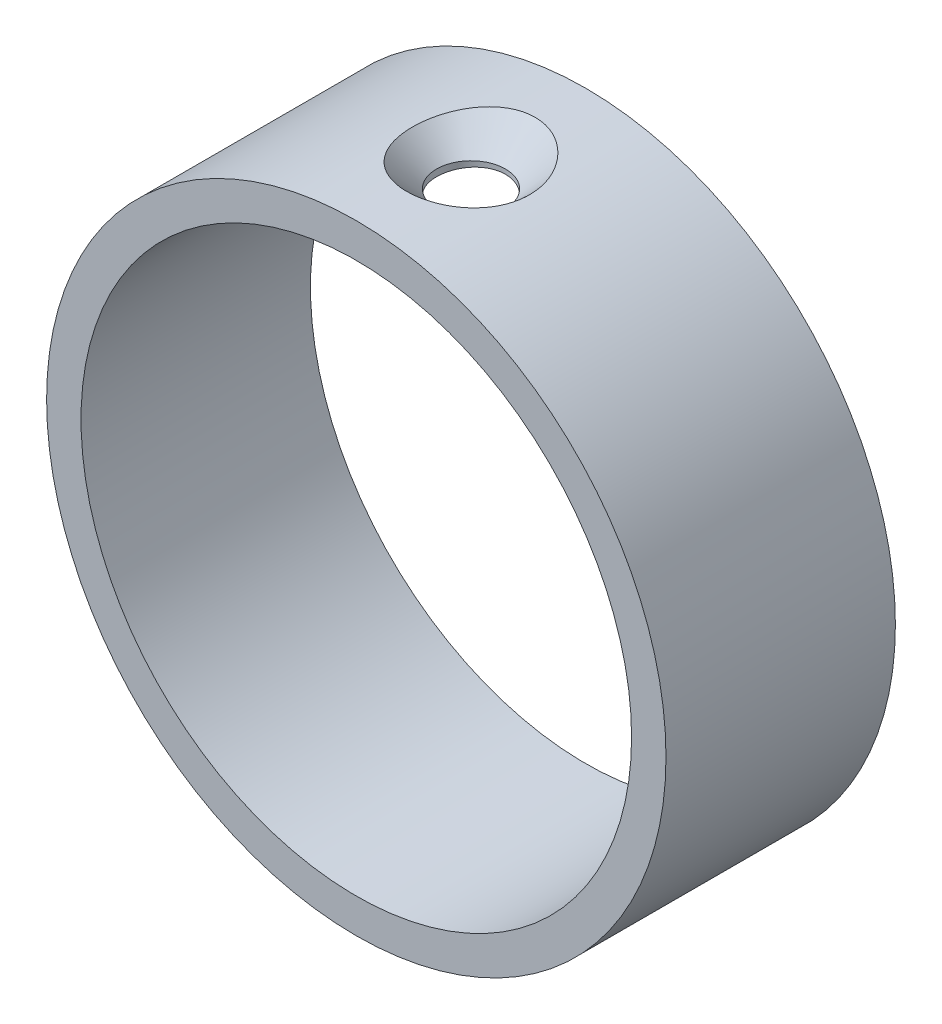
ISO-10303-21;
HEADER;
FILE_DESCRIPTION(('STEP AP214'),'2;1');
FILE_NAME('part.step','',(''),(''),'','','');
FILE_SCHEMA(('AUTOMOTIVE_DESIGN { 1 0 10303 214 1 1 1 1 }'));
ENDSEC;
DATA;
#1=APPLICATION_CONTEXT('core data for automotive mechanical design processes');
#2=APPLICATION_PROTOCOL_DEFINITION('international standard','automotive_design',2000,#1);
#3=PRODUCT_CONTEXT('',#1,'mechanical');
#4=PRODUCT('Part','Part','',(#3));
#5=PRODUCT_RELATED_PRODUCT_CATEGORY('part','',(#4));
#6=PRODUCT_DEFINITION_FORMATION('','',#4);
#7=PRODUCT_DEFINITION_CONTEXT('part definition',#1,'design');
#8=PRODUCT_DEFINITION('design','',#6,#7);
#9=PRODUCT_DEFINITION_SHAPE('','',#8);
#10=(LENGTH_UNIT() NAMED_UNIT(*) SI_UNIT(.MILLI.,.METRE.));
#11=(NAMED_UNIT(*) PLANE_ANGLE_UNIT() SI_UNIT($,.RADIAN.));
#12=(NAMED_UNIT(*) SI_UNIT($,.STERADIAN.) SOLID_ANGLE_UNIT());
#13=UNCERTAINTY_MEASURE_WITH_UNIT(LENGTH_MEASURE(1.E-05),#10,'distance_accuracy_value','');
#14=(GEOMETRIC_REPRESENTATION_CONTEXT(3) GLOBAL_UNCERTAINTY_ASSIGNED_CONTEXT((#13)) GLOBAL_UNIT_ASSIGNED_CONTEXT((#10,
#11,#12)) REPRESENTATION_CONTEXT('',''));
#15=CARTESIAN_POINT('',(0.,0.,0.));
#16=DIRECTION('',(0.,0.,1.));
#17=DIRECTION('',(1.,0.,0.));
#18=AXIS2_PLACEMENT_3D('',#15,#16,#17);
#19=CARTESIAN_POINT('',(0.,0.,5.));
#20=DIRECTION('',(0.,0.,1.));
#21=DIRECTION('',(1.,0.,0.));
#22=AXIS2_PLACEMENT_3D('',#19,#20,#21);
#23=PLANE('',#22);
#24=CARTESIAN_POINT('',(0.,0.,5.));
#25=DIRECTION('',(0.,0.,1.));
#26=DIRECTION('',(1.,0.,0.));
#27=AXIS2_PLACEMENT_3D('',#24,#25,#26);
#28=CIRCLE('',#27,13.5);
#29=CARTESIAN_POINT('',(13.5,0.,5.));
#30=VERTEX_POINT('',#29);
#31=EDGE_CURVE('E10',#30,#30,#28,.T.);
#32=ORIENTED_EDGE('',*,*,#31,.T.);
#33=EDGE_LOOP('',(#32));
#34=FACE_BOUND('',#33,.T.);
#35=CARTESIAN_POINT('',(0.,0.,5.));
#36=DIRECTION('',(0.,0.,1.));
#37=DIRECTION('',(1.,0.,0.));
#38=AXIS2_PLACEMENT_3D('',#35,#36,#37);
#39=CIRCLE('',#38,12.);
#40=CARTESIAN_POINT('',(12.,0.,5.));
#41=VERTEX_POINT('',#40);
#42=EDGE_CURVE('E47',#41,#41,#39,.T.);
#43=ORIENTED_EDGE('',*,*,#42,.F.);
#44=EDGE_LOOP('',(#43));
#45=FACE_BOUND('',#44,.T.);
#46=ADVANCED_FACE('F30',(#34,#45),#23,.T.);
#47=CARTESIAN_POINT('',(0.,0.,-5.));
#48=DIRECTION('',(0.,0.,1.));
#49=DIRECTION('',(1.,0.,0.));
#50=AXIS2_PLACEMENT_3D('',#47,#48,#49);
#51=PLANE('',#50);
#52=CARTESIAN_POINT('',(0.,0.,-5.));
#53=DIRECTION('',(0.,0.,1.));
#54=DIRECTION('',(1.,0.,0.));
#55=AXIS2_PLACEMENT_3D('',#52,#53,#54);
#56=CIRCLE('',#55,13.5);
#57=CARTESIAN_POINT('',(13.5,0.,-5.));
#58=VERTEX_POINT('',#57);
#59=EDGE_CURVE('E42',#58,#58,#56,.T.);
#60=ORIENTED_EDGE('',*,*,#59,.F.);
#61=EDGE_LOOP('',(#60));
#62=FACE_BOUND('',#61,.T.);
#63=CARTESIAN_POINT('',(0.,0.,-5.));
#64=DIRECTION('',(0.,0.,1.));
#65=DIRECTION('',(1.,0.,0.));
#66=AXIS2_PLACEMENT_3D('',#63,#64,#65);
#67=CIRCLE('',#66,12.);
#68=CARTESIAN_POINT('',(12.,0.,-5.));
#69=VERTEX_POINT('',#68);
#70=EDGE_CURVE('E50',#69,#69,#67,.T.);
#71=ORIENTED_EDGE('',*,*,#70,.T.);
#72=EDGE_LOOP('',(#71));
#73=FACE_BOUND('',#72,.T.);
#74=ADVANCED_FACE('F77',(#62,#73),#51,.F.);
#75=CARTESIAN_POINT('',(0.,0.,5.));
#76=DIRECTION('',(0.,0.,-1.));
#77=DIRECTION('',(-1.,0.,0.));
#78=AXIS2_PLACEMENT_3D('',#75,#76,#77);
#79=CYLINDRICAL_SURFACE('',#78,13.5);
#80=CARTESIAN_POINT('',(-1.6988849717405,13.3926767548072,-2.08909016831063));
#81=CARTESIAN_POINT('',(-1.60373888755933,13.4047455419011,-2.18202193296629));
#82=CARTESIAN_POINT('',(-1.50160873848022,13.416669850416,-2.26782974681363));
#83=CARTESIAN_POINT('',(-1.28508464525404,13.4391365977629,-2.4226034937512));
#84=CARTESIAN_POINT('',(-1.17068915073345,13.4496788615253,-2.49156729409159));
#85=CARTESIAN_POINT('',(-0.921974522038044,13.4691036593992,-2.61507944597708));
#86=CARTESIAN_POINT('',(-0.786789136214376,13.4777731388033,-2.66793596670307));
#87=CARTESIAN_POINT('',(-0.508848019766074,13.4911223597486,-2.74814392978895));
#88=CARTESIAN_POINT('',(-0.36609473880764,13.4958033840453,-2.77550357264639));
#89=CARTESIAN_POINT('',(-0.0899266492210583,13.5003478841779,-2.80204928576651));
#90=CARTESIAN_POINT('',(0.043278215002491,13.5005794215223,-2.80338792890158));
#91=CARTESIAN_POINT('',(0.30788108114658,13.4971369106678,-2.78330297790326));
#92=CARTESIAN_POINT('',(0.439279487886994,13.4934637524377,-2.76188457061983));
#93=CARTESIAN_POINT('',(0.69287437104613,13.4827894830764,-2.69822903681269));
#94=CARTESIAN_POINT('',(0.815224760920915,13.4758830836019,-2.65658320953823));
#95=CARTESIAN_POINT('',(1.05160814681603,13.4595013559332,-2.55450264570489));
#96=CARTESIAN_POINT('',(1.16563965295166,13.4500255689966,-2.49406455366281));
#97=CARTESIAN_POINT('',(1.38857166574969,13.4288887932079,-2.35305315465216));
#98=CARTESIAN_POINT('',(1.49691037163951,13.4171407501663,-2.2716072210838));
#99=CARTESIAN_POINT('',(1.69973629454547,13.3929590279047,-2.09309548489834));
#100=CARTESIAN_POINT('',(1.79421845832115,13.3805251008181,-1.99602401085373));
#101=CARTESIAN_POINT('',(1.97583201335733,13.3549716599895,-1.77947537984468));
#102=CARTESIAN_POINT('',(2.06149250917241,13.3418939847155,-1.65875944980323));
#103=CARTESIAN_POINT('',(2.21318560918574,13.3175720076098,-1.40540593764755));
#104=CARTESIAN_POINT('',(2.2792109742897,13.3063283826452,-1.2727639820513));
#105=CARTESIAN_POINT('',(2.39519974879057,13.2859620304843,-0.987745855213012));
#106=CARTESIAN_POINT('',(2.44342300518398,13.2770857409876,-0.834641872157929));
#107=CARTESIAN_POINT('',(2.5149932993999,13.2637150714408,-0.522539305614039));
#108=CARTESIAN_POINT('',(2.53833474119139,13.2592216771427,-0.363539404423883));
#109=CARTESIAN_POINT('',(2.56019163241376,13.2550203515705,-0.037139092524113));
#110=CARTESIAN_POINT('',(2.55763906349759,13.2555182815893,0.130336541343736));
#111=CARTESIAN_POINT('',(2.52516204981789,13.2617427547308,0.462532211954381));
#112=CARTESIAN_POINT('',(2.49523417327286,13.2674699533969,0.627251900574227));
#113=CARTESIAN_POINT('',(2.40823906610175,13.2835366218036,0.950347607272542));
#114=CARTESIAN_POINT('',(2.35099012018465,13.2939069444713,1.10867333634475));
#115=CARTESIAN_POINT('',(2.21029518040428,13.3180203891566,1.41300525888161));
#116=CARTESIAN_POINT('',(2.12684818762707,13.3317636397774,1.55901098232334));
#117=CARTESIAN_POINT('',(1.93774382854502,13.3605404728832,1.83032398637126));
#118=CARTESIAN_POINT('',(1.83269338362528,13.375533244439,1.95605722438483));
#119=CARTESIAN_POINT('',(1.60138135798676,13.4051898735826,2.18632276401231));
#120=CARTESIAN_POINT('',(1.47512956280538,13.4198538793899,2.29086479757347));
#121=CARTESIAN_POINT('',(1.21456702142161,13.4458423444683,2.46723423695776));
#122=CARTESIAN_POINT('',(1.08151420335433,13.4573323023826,2.54089061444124));
#123=CARTESIAN_POINT('',(0.803798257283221,13.4767649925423,2.66216904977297));
#124=CARTESIAN_POINT('',(0.659145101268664,13.4847107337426,2.70981319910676));
#125=CARTESIAN_POINT('',(0.377921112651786,13.495369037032,2.77306980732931));
#126=CARTESIAN_POINT('',(0.24197345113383,13.4985227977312,2.79139255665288));
#127=CARTESIAN_POINT('',(-0.0310390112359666,13.5006532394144,2.80380886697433));
#128=CARTESIAN_POINT('',(-0.168103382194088,13.4996314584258,2.7979113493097));
#129=CARTESIAN_POINT('',(-0.431383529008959,13.4937134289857,2.76321970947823));
#130=CARTESIAN_POINT('',(-0.557778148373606,13.4890363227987,2.7357201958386));
#131=CARTESIAN_POINT('',(-0.804279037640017,13.4765862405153,2.66066329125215));
#132=CARTESIAN_POINT('',(-0.924384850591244,13.4688130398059,2.61310444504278));
#133=CARTESIAN_POINT('',(-1.15851937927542,13.4507248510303,2.49833567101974));
#134=CARTESIAN_POINT('',(-1.27230479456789,13.4403483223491,2.43064126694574));
#135=CARTESIAN_POINT('',(-1.48794145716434,13.418189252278,2.2785702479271));
#136=CARTESIAN_POINT('',(-1.58978893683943,13.4064062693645,2.19418838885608));
#137=CARTESIAN_POINT('',(-1.7877780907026,13.3815034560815,2.00363624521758));
#138=CARTESIAN_POINT('',(-1.88272909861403,13.3683542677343,1.89623356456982));
#139=CARTESIAN_POINT('',(-2.05502684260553,13.3429556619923,1.66804635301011));
#140=CARTESIAN_POINT('',(-2.13236664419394,13.3307066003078,1.54725657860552));
#141=CARTESIAN_POINT('',(-2.27444375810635,13.3072374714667,1.28404029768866));
#142=CARTESIAN_POINT('',(-2.33742103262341,13.2962091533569,1.14064487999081));
#143=CARTESIAN_POINT('',(-2.44011898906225,13.2777463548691,0.845539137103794));
#144=CARTESIAN_POINT('',(-2.47983360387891,13.270312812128,0.693826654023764));
#145=CARTESIAN_POINT('',(-2.53693349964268,13.2595204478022,0.377299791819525));
#146=CARTESIAN_POINT('',(-2.55294435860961,13.2564130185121,0.212227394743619));
#147=CARTESIAN_POINT('',(-2.558037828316,13.2554307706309,-0.118376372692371));
#148=CARTESIAN_POINT('',(-2.54711378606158,13.257557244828,-0.283907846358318));
#149=CARTESIAN_POINT('',(-2.49809753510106,13.2668813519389,-0.613712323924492));
#150=CARTESIAN_POINT('',(-2.45953643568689,13.2741664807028,-0.777913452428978));
#151=CARTESIAN_POINT('',(-2.35541366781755,13.2930361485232,-1.09725014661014));
#152=CARTESIAN_POINT('',(-2.2898615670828,13.3046191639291,-1.25238890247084));
#153=CARTESIAN_POINT('',(-2.14417369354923,13.3288085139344,-1.52765652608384));
#154=CARTESIAN_POINT('',(-2.06743615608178,13.3410352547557,-1.64962706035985));
#155=CARTESIAN_POINT('',(-1.89613169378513,13.3664567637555,-1.88018900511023));
#156=CARTESIAN_POINT('',(-1.80157616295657,13.3796509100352,-1.98878889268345));
#157=CARTESIAN_POINT('',(-1.6988849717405,13.3926767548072,-2.08909016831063));
#158=B_SPLINE_CURVE_WITH_KNOTS('',3,(#80,#81,#82,#83,#84,#85,#86,#87,#88,#89,#90,#91,#92,#93,
#94,#95,#96,#97,#98,#99,#100,#101,#102,#103,#104,#105,#106,#107,#108,#109,#110,#111,#112,#113,
#114,#115,#116,#117,#118,#119,#120,#121,#122,#123,#124,#125,#126,#127,#128,#129,#130,#131,#132,
#133,#134,#135,#136,#137,#138,#139,#140,#141,#142,#143,#144,#145,#146,#147,#148,#149,#150,#151,
#152,#153,#154,#155,#156,#157),.UNSPECIFIED.,.T.,.F.,(4,2,2,2,2,2,2,2,2,2,2,2,2,2,2,2,2,2,2,2,2,
2,2,2,2,2,2,2,2,2,2,2,2,2,2,2,2,2,4),(0.,0.400235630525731,0.800521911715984,1.23434481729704,
1.66802814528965,2.06566717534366,2.46321559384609,2.8497846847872,3.23642283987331,
3.64286070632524,4.04944642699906,4.49335458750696,4.93742620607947,5.41756618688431,
5.89781413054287,6.3979482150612,6.89814500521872,7.40171603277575,7.90530626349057,
8.39631613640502,8.88710000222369,9.34211542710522,9.79674381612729,10.206240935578,
10.615587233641,11.0021160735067,11.3886729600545,11.7854086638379,12.1822692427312,
12.6123397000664,13.0425792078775,13.5115299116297,13.9806028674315,14.4759339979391,
14.9713874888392,15.4754521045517,15.9793381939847,16.4115880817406,16.8435624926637),.UNSPECIFIED.);
#159=CARTESIAN_POINT('',(-1.6988849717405,13.3926767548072,-2.08909016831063));
#160=VERTEX_POINT('',#159);
#161=EDGE_CURVE('E35',#160,#160,#158,.T.);
#162=ORIENTED_EDGE('',*,*,#161,.T.);
#163=EDGE_LOOP('',(#162));
#164=FACE_BOUND('',#163,.T.);
#165=ORIENTED_EDGE('',*,*,#31,.F.);
#166=EDGE_LOOP('',(#165));
#167=FACE_BOUND('',#166,.T.);
#168=ORIENTED_EDGE('',*,*,#59,.T.);
#169=EDGE_LOOP('',(#168));
#170=FACE_BOUND('',#169,.T.);
#171=ADVANCED_FACE('F32',(#164,#167,#170),#79,.T.);
#172=CARTESIAN_POINT('',(0.,0.,5.));
#173=DIRECTION('',(0.,0.,-1.));
#174=DIRECTION('',(-1.,0.,0.));
#175=AXIS2_PLACEMENT_3D('',#172,#173,#174);
#176=CYLINDRICAL_SURFACE('',#175,12.);
#177=CARTESIAN_POINT('',(0.,12.,-1.5));
#178=CARTESIAN_POINT('',(0.0839046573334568,11.9999988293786,-1.49999643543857));
#179=CARTESIAN_POINT('',(0.167861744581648,11.9991107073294,-1.49293627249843));
#180=CARTESIAN_POINT('',(0.333439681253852,11.9956532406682,-1.46488334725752));
#181=CARTESIAN_POINT('',(0.415057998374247,11.9930821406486,-1.44387603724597));
#182=CARTESIAN_POINT('',(0.573537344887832,11.9865483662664,-1.38855741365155));
#183=CARTESIAN_POINT('',(0.650401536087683,11.9825866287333,-1.35425505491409));
#184=CARTESIAN_POINT('',(0.797267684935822,11.9737122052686,-1.27333962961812));
#185=CARTESIAN_POINT('',(0.867270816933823,11.9687996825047,-1.22672867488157));
#186=CARTESIAN_POINT('',(0.99882769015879,11.958541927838,-1.12224483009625));
#187=CARTESIAN_POINT('',(1.06033821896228,11.9531946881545,-1.06431772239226));
#188=CARTESIAN_POINT('',(1.1727916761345,11.9426863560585,-0.938962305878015));
#189=CARTESIAN_POINT('',(1.22373406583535,11.9375252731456,-0.871533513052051));
#190=CARTESIAN_POINT('',(1.31376609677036,11.9279538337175,-0.728808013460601));
#191=CARTESIAN_POINT('',(1.35281525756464,11.9235460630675,-0.653485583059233));
#192=CARTESIAN_POINT('',(1.41769384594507,11.9160067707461,-0.497287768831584));
#193=CARTESIAN_POINT('',(1.44352377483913,11.9128752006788,-0.416412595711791));
#194=CARTESIAN_POINT('',(1.48109938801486,11.9082620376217,-0.25185348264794));
#195=CARTESIAN_POINT('',(1.49291802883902,11.9067719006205,-0.168186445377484));
#196=CARTESIAN_POINT('',(1.50236132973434,11.9055841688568,-4.42419168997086E-05));
#197=CARTESIAN_POINT('',(1.49998656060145,11.9058865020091,0.0844308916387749));
#198=CARTESIAN_POINT('',(1.48117034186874,11.9082417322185,0.25128289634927));
#199=CARTESIAN_POINT('',(1.46480925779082,11.910284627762,0.333668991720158));
#200=CARTESIAN_POINT('',(1.41861022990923,11.9158751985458,0.494517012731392));
#201=CARTESIAN_POINT('',(1.38877201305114,11.9194229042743,0.572978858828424));
#202=CARTESIAN_POINT('',(1.31637933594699,11.9276346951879,0.724000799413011));
#203=CARTESIAN_POINT('',(1.27378995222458,11.9323018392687,0.796543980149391));
#204=CARTESIAN_POINT('',(1.17712888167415,11.9422242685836,0.933484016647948));
#205=CARTESIAN_POINT('',(1.12305666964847,11.947479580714,0.997880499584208));
#206=CARTESIAN_POINT('',(1.00451946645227,11.9580306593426,1.11716562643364));
#207=CARTESIAN_POINT('',(0.939985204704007,11.9633264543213,1.17198545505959));
#208=CARTESIAN_POINT('',(0.802594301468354,11.9733277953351,1.27002532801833));
#209=CARTESIAN_POINT('',(0.729737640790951,11.978033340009,1.3132453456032));
#210=CARTESIAN_POINT('',(0.577717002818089,11.9863269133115,1.38685879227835));
#211=CARTESIAN_POINT('',(0.49855091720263,11.9899145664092,1.41724791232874));
#212=CARTESIAN_POINT('',(0.336184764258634,11.9955647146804,1.46428229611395));
#213=CARTESIAN_POINT('',(0.2529848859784,11.9976272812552,1.48092820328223));
#214=CARTESIAN_POINT('',(0.0855078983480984,11.9999855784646,1.49991445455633));
#215=CARTESIAN_POINT('',(0.00124169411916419,12.0002930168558,1.50234959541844));
#216=CARTESIAN_POINT('',(-0.166497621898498,11.9991380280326,1.49309535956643));
#217=CARTESIAN_POINT('',(-0.249970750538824,11.9976756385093,1.48140628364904));
#218=CARTESIAN_POINT('',(-0.413474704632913,11.9931526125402,1.44431417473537));
#219=CARTESIAN_POINT('',(-0.493515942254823,11.9900972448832,1.41895634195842));
#220=CARTESIAN_POINT('',(-0.648209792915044,11.9827303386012,1.35529352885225));
#221=CARTESIAN_POINT('',(-0.722862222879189,11.9784187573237,1.31698810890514));
#222=CARTESIAN_POINT('',(-0.865082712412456,11.9689909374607,1.22828811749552));
#223=CARTESIAN_POINT('',(-0.932612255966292,11.9638706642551,1.17783222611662));
#224=CARTESIAN_POINT('',(-1.05827819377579,11.9534108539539,1.06635030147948));
#225=CARTESIAN_POINT('',(-1.11641421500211,11.9480713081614,1.00532384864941));
#226=CARTESIAN_POINT('',(-1.22197917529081,11.9377386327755,0.874015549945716));
#227=CARTESIAN_POINT('',(-1.26934527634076,11.932747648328,0.803682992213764));
#228=CARTESIAN_POINT('',(-1.3515917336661,11.9237124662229,0.656005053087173));
#229=CARTESIAN_POINT('',(-1.38647234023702,11.9196682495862,0.578659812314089));
#230=CARTESIAN_POINT('',(-1.44265594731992,11.912999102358,0.419354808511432));
#231=CARTESIAN_POINT('',(-1.46399437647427,11.9103704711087,0.337407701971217));
#232=CARTESIAN_POINT('',(-1.49260199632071,11.9068194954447,0.171058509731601));
#233=CARTESIAN_POINT('',(-1.49987184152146,11.9058970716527,0.0866565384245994));
#234=CARTESIAN_POINT('',(-1.5001239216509,11.9058652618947,-0.081581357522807));
#235=CARTESIAN_POINT('',(-1.49320487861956,11.9067433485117,-0.165417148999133));
#236=CARTESIAN_POINT('',(-1.4654846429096,11.9101866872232,-0.330724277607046));
#237=CARTESIAN_POINT('',(-1.44468344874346,11.9127519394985,-0.412195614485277));
#238=CARTESIAN_POINT('',(-1.38982024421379,11.9192766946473,-0.570448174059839));
#239=CARTESIAN_POINT('',(-1.35576298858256,11.9232356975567,-0.647231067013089));
#240=CARTESIAN_POINT('',(-1.27536414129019,11.9321026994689,-0.794007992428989));
#241=CARTESIAN_POINT('',(-1.22902239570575,11.9370107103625,-0.864001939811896));
#242=CARTESIAN_POINT('',(-1.1250037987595,11.9472636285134,-0.995718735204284));
#243=CARTESIAN_POINT('',(-1.06725337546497,11.9526112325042,-1.05738327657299));
#244=CARTESIAN_POINT('',(-0.942210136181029,11.9631169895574,-1.17018409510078));
#245=CARTESIAN_POINT('',(-0.87491507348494,11.9682750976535,-1.22131788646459));
#246=CARTESIAN_POINT('',(-0.732399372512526,11.9778423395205,-1.31177121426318));
#247=CARTESIAN_POINT('',(-0.657149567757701,11.9822485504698,-1.35104508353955));
#248=CARTESIAN_POINT('',(-0.501109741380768,11.9897858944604,-1.41634274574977));
#249=CARTESIAN_POINT('',(-0.420325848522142,11.9929184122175,-1.44238093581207));
#250=CARTESIAN_POINT('',(-0.282603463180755,11.9968003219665,-1.47423560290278));
#251=CARTESIAN_POINT('',(-0.226533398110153,11.9979943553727,-1.48388336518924));
#252=CARTESIAN_POINT('',(-0.113650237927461,11.9995945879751,-1.49676674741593));
#253=CARTESIAN_POINT('',(-0.0568371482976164,12.0000007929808,-1.50000241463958));
#254=CARTESIAN_POINT('',(0.,12.,-1.5));
#255=B_SPLINE_CURVE_WITH_KNOTS('',3,(#177,#178,#179,#180,#181,#182,#183,#184,#185,#186,#187,
#188,#189,#190,#191,#192,#193,#194,#195,#196,#197,#198,#199,#200,#201,#202,#203,#204,#205,#206,
#207,#208,#209,#210,#211,#212,#213,#214,#215,#216,#217,#218,#219,#220,#221,#222,#223,#224,#225,
#226,#227,#228,#229,#230,#231,#232,#233,#234,#235,#236,#237,#238,#239,#240,#241,#242,#243,#244,
#245,#246,#247,#248,#249,#250,#251,#252,#253,#254),.UNSPECIFIED.,.T.,.F.,(4,2,2,2,2,2,2,2,2,2,2,
2,2,2,2,2,2,2,2,2,2,2,2,2,2,2,2,2,2,2,2,2,2,2,2,2,2,2,4),(0.,0.251506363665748,
0.503275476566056,0.754875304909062,1.00643199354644,1.25922487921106,1.51203064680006,
1.76568750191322,2.01933473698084,2.27165535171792,2.52396581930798,2.77483617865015,
3.02571162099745,3.2772805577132,3.52886100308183,3.7821808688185,4.03550131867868,
4.28890677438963,4.54230036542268,4.79400167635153,5.04569762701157,5.29656632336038,
5.54744353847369,5.79961441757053,6.05179530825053,6.30541182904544,6.55902326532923,
6.81196844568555,7.06490185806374,7.31608140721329,7.56726098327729,7.81835054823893,
8.06944325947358,8.32221142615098,8.57503919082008,8.82882841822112,9.0823409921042,
9.25271305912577,9.42308386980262),.UNSPECIFIED.);
#256=CARTESIAN_POINT('',(0.,12.,-1.5));
#257=VERTEX_POINT('',#256);
#258=EDGE_CURVE('E52',#257,#257,#255,.T.);
#259=ORIENTED_EDGE('',*,*,#258,.F.);
#260=EDGE_LOOP('',(#259));
#261=FACE_BOUND('',#260,.T.);
#262=ORIENTED_EDGE('',*,*,#42,.T.);
#263=EDGE_LOOP('',(#262));
#264=FACE_BOUND('',#263,.T.);
#265=ORIENTED_EDGE('',*,*,#70,.F.);
#266=EDGE_LOOP('',(#265));
#267=FACE_BOUND('',#266,.T.);
#268=ADVANCED_FACE('F59',(#261,#264,#267),#176,.F.);
#269=CARTESIAN_POINT('',(0.,12.2,0.));
#270=DIRECTION('',(0.,1.,0.));
#271=DIRECTION('',(0.,0.,1.));
#272=AXIS2_PLACEMENT_3D('',#269,#270,#271);
#273=CONICAL_SURFACE('',#272,1.5,0.78539816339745);
#274=CARTESIAN_POINT('',(0.,12.2,0.));
#275=DIRECTION('',(0.,-1.,0.));
#276=DIRECTION('',(0.,0.,-1.));
#277=AXIS2_PLACEMENT_3D('',#274,#275,#276);
#278=CIRCLE('',#277,1.5);
#279=CARTESIAN_POINT('',(0.,12.2,-1.5));
#280=VERTEX_POINT('',#279);
#281=EDGE_CURVE('E58',#280,#280,#278,.T.);
#282=ORIENTED_EDGE('',*,*,#281,.T.);
#283=EDGE_LOOP('',(#282));
#284=FACE_BOUND('',#283,.T.);
#285=ORIENTED_EDGE('',*,*,#161,.F.);
#286=EDGE_LOOP('',(#285));
#287=FACE_BOUND('',#286,.T.);
#288=ADVANCED_FACE('F65',(#284,#287),#273,.F.);
#289=CARTESIAN_POINT('',(0.,0.,0.));
#290=DIRECTION('',(0.,-1.,0.));
#291=DIRECTION('',(0.,0.,-1.));
#292=AXIS2_PLACEMENT_3D('',#289,#290,#291);
#293=CYLINDRICAL_SURFACE('',#292,1.5);
#294=ORIENTED_EDGE('',*,*,#258,.T.);
#295=EDGE_LOOP('',(#294));
#296=FACE_BOUND('',#295,.T.);
#297=ORIENTED_EDGE('',*,*,#281,.F.);
#298=EDGE_LOOP('',(#297));
#299=FACE_BOUND('',#298,.T.);
#300=ADVANCED_FACE('F62',(#296,#299),#293,.F.);
#301=CLOSED_SHELL('',(#46,#74,#171,#268,#288,#300));
#302=MANIFOLD_SOLID_BREP('B2',#301);
#303=ADVANCED_BREP_SHAPE_REPRESENTATION('',(#18,#302),#14);
#304=SHAPE_DEFINITION_REPRESENTATION(#9,#303);
ENDSEC;
END-ISO-10303-21;
